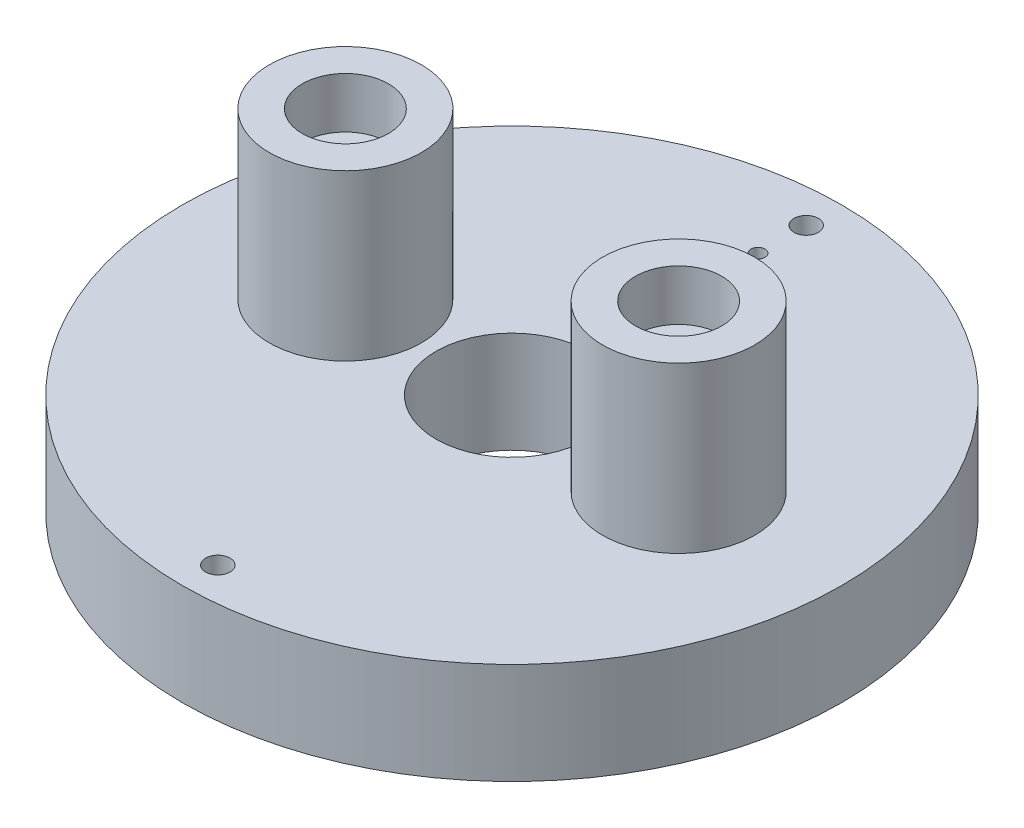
from build123d import *

# Parameters (mm, degrees)
SKETCH1_R                      = 32.5
SKETCH1_R_2                    = 7.5
BOSS_EXTRUDE1_DEPTH            = 10
SKETCH2_R                      = 7.5
BOSS_EXTRUDE2_DEPTH            = 11.25
SKETCH4_R                      = 0.7
CUT_EXTRUDE1_DEPTH             = 10
CBORE_FOR_M2_SHCS1_D           = 2.4
CBORE_FOR_M2_SHCS1_CBORE_D     = 4.4
CBORE_FOR_M2_SHCS1_CBORE_DEPTH = 8
SKETCH12_R                     = 7.5
SKETCH12_R_2                   = 4.25
BOSS_EXTRUDE3_DEPTH            = 5


with BuildPart() as part:
    # Sketch1 → Boss-Extrude1 (new body)
    with BuildSketch(Plane(origin=(0, 0, 0), x_dir=(1, 0, 0), z_dir=(0, 1, 0))):
        with Locations(Location((0, 0, 0), (0, 0, 270))):
            Circle(SKETCH1_R)
        with Locations(Location((0, 0, 0), (0, 0, 270))):
            Circle(SKETCH1_R_2, mode=Mode.SUBTRACT)
    extrude(amount=BOSS_EXTRUDE1_DEPTH)

    # Sketch2 → Boss-Extrude2 (add)
    with BuildSketch(Plane(origin=(0, 10, 0), x_dir=(1, 0, 0), z_dir=(0, 1, 0))):
        with Locations(Location((16.425, 0, 0), (0, 0, 90))):
            Circle(SKETCH2_R)
        with Locations(Location((-16.425, 0, 0), (0, 0, 90))):
            Circle(SKETCH2_R)
    extrude(amount=BOSS_EXTRUDE2_DEPTH)

    # Sketch4 → Cut-Extrude1 (cut)
    with BuildSketch(Plane.XZ):
        with Locations(Location((0, -24.25, 0), (0, 0, 270))):
            Circle(SKETCH4_R)
    extrude(amount=-CUT_EXTRUDE1_DEPTH, mode=Mode.SUBTRACT)

    # CBORE for M2 SHCS1 (through all)
    with Locations(Plane(origin=(0, 0, 0), x_dir=(-1, 0, 0), z_dir=(0, -1, 0))):
        with Locations((0, -29), (0, 29)):
            CounterBoreHole(CBORE_FOR_M2_SHCS1_D / 2, CBORE_FOR_M2_SHCS1_CBORE_D / 2, CBORE_FOR_M2_SHCS1_CBORE_DEPTH)

    # Sketch12 → Boss-Extrude3 (add)
    # profile 1 of 2: a face of its own
    with BuildSketch(Plane(origin=(0, 21.25, 0), x_dir=(1, 0, 0), z_dir=(0, 1, 0))):
        with Locations(Location((-16.425, 0, 0), (0, 0, 90))):
            Circle(SKETCH12_R)
        with Locations(Location((-16.425, 0, 0), (0, 0, 270))):
            Circle(SKETCH12_R_2, mode=Mode.SUBTRACT)
    # profile 2 of 2: a face of its own
    with BuildSketch(Plane(origin=(0, 21.25, 0), x_dir=(1, 0, 0), z_dir=(0, 1, 0))):
        with Locations(Location((16.425, 0, 0), (0, 0, 90))):
            Circle(SKETCH12_R)
        with Locations(Location((16.425, 0, 0), (0, 0, 270))):
            Circle(SKETCH12_R_2, mode=Mode.SUBTRACT)
    extrude(amount=BOSS_EXTRUDE3_DEPTH)


solid = part.part
